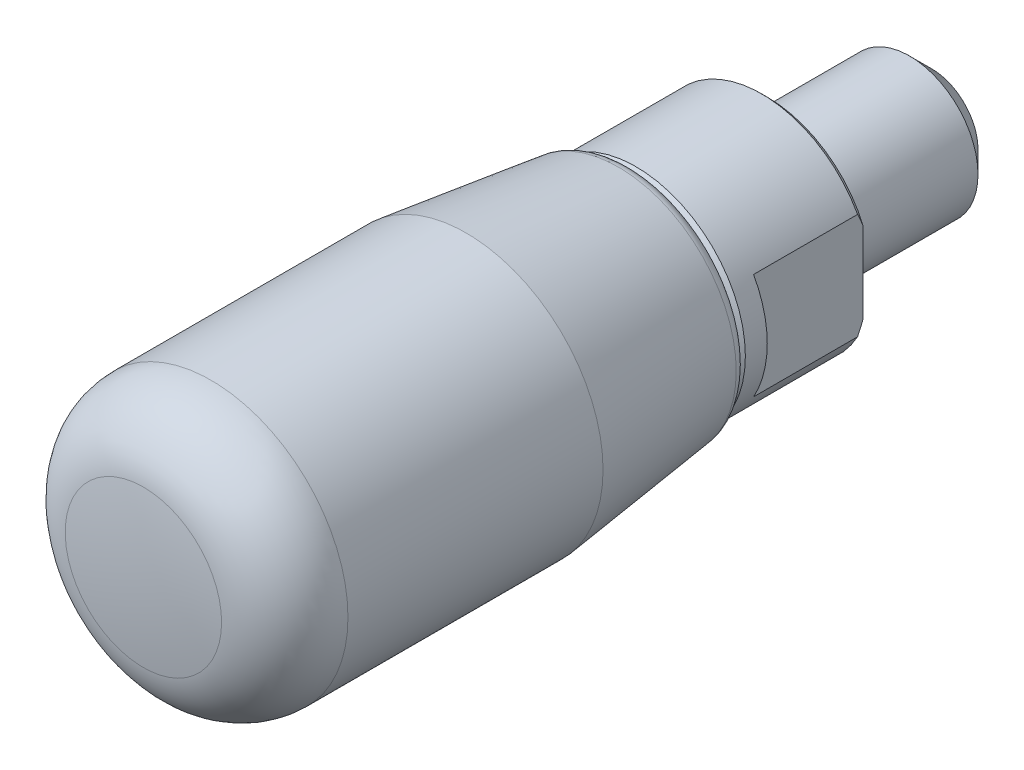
ISO-10303-21;
HEADER;
FILE_DESCRIPTION(('STEP AP214'),'2;1');
FILE_NAME('part.step','',(''),(''),'','','');
FILE_SCHEMA(('AUTOMOTIVE_DESIGN { 1 0 10303 214 1 1 1 1 }'));
ENDSEC;
DATA;
#1=APPLICATION_CONTEXT('core data for automotive mechanical design processes');
#2=APPLICATION_PROTOCOL_DEFINITION('international standard','automotive_design',2000,#1);
#3=PRODUCT_CONTEXT('',#1,'mechanical');
#4=PRODUCT('Part','Part','',(#3));
#5=PRODUCT_RELATED_PRODUCT_CATEGORY('part','',(#4));
#6=PRODUCT_DEFINITION_FORMATION('','',#4);
#7=PRODUCT_DEFINITION_CONTEXT('part definition',#1,'design');
#8=PRODUCT_DEFINITION('design','',#6,#7);
#9=PRODUCT_DEFINITION_SHAPE('','',#8);
#10=(LENGTH_UNIT() NAMED_UNIT(*) SI_UNIT(.MILLI.,.METRE.));
#11=(NAMED_UNIT(*) PLANE_ANGLE_UNIT() SI_UNIT($,.RADIAN.));
#12=(NAMED_UNIT(*) SI_UNIT($,.STERADIAN.) SOLID_ANGLE_UNIT());
#13=UNCERTAINTY_MEASURE_WITH_UNIT(LENGTH_MEASURE(1.E-05),#10,'distance_accuracy_value','');
#14=(GEOMETRIC_REPRESENTATION_CONTEXT(3) GLOBAL_UNCERTAINTY_ASSIGNED_CONTEXT((#13)) GLOBAL_UNIT_ASSIGNED_CONTEXT((#10,
#11,#12)) REPRESENTATION_CONTEXT('',''));
#15=CARTESIAN_POINT('',(0.,0.,0.));
#16=DIRECTION('',(0.,0.,1.));
#17=DIRECTION('',(1.,0.,0.));
#18=AXIS2_PLACEMENT_3D('',#15,#16,#17);
#19=CARTESIAN_POINT('',(0.,3.8,0.));
#20=DIRECTION('',(0.,0.,1.));
#21=DIRECTION('',(1.,0.,0.));
#22=AXIS2_PLACEMENT_3D('',#19,#20,#21);
#23=PLANE('',#22);
#24=CARTESIAN_POINT('',(0.,0.,0.));
#25=DIRECTION('',(0.,0.,1.));
#26=DIRECTION('',(1.,0.,0.));
#27=AXIS2_PLACEMENT_3D('',#24,#25,#26);
#28=CIRCLE('',#27,2.5);
#29=CARTESIAN_POINT('',(2.5,0.,0.));
#30=VERTEX_POINT('',#29);
#31=EDGE_CURVE('E94',#30,#30,#28,.T.);
#32=ORIENTED_EDGE('',*,*,#31,.T.);
#33=EDGE_LOOP('',(#32));
#34=FACE_BOUND('',#33,.T.);
#35=DIRECTION('',(0.,1.,0.));
#36=VECTOR('',#35,1.);
#37=CARTESIAN_POINT('',(-3.5,1.95,0.));
#38=LINE('',#37,#36);
#39=CARTESIAN_POINT('',(-3.5,-1.47986485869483,0.));
#40=VERTEX_POINT('',#39);
#41=CARTESIAN_POINT('',(-3.5,1.47986485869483,0.));
#42=VERTEX_POINT('',#41);
#43=EDGE_CURVE('E68',#40,#42,#38,.T.);
#44=ORIENTED_EDGE('',*,*,#43,.T.);
#45=CARTESIAN_POINT('',(0.,0.,0.));
#46=DIRECTION('',(0.,0.,1.));
#47=DIRECTION('',(1.,0.,0.));
#48=AXIS2_PLACEMENT_3D('',#45,#46,#47);
#49=CIRCLE('',#48,3.8);
#50=CARTESIAN_POINT('',(3.5,1.47986485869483,0.));
#51=VERTEX_POINT('',#50);
#52=EDGE_CURVE('E91',#51,#42,#49,.T.);
#53=ORIENTED_EDGE('',*,*,#52,.F.);
#54=DIRECTION('',(0.,1.,0.));
#55=VECTOR('',#54,1.);
#56=CARTESIAN_POINT('',(3.5,1.95,0.));
#57=LINE('',#56,#55);
#58=CARTESIAN_POINT('',(3.5,-1.47986485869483,0.));
#59=VERTEX_POINT('',#58);
#60=EDGE_CURVE('E90',#59,#51,#57,.T.);
#61=ORIENTED_EDGE('',*,*,#60,.F.);
#62=EDGE_CURVE('E85',#40,#59,#49,.T.);
#63=ORIENTED_EDGE('',*,*,#62,.F.);
#64=EDGE_LOOP('',(#44,#53,#61,#63));
#65=FACE_BOUND('',#64,.T.);
#66=ADVANCED_FACE('F14',(#34,#65),#23,.F.);
#67=CARTESIAN_POINT('',(0.,0.,0.));
#68=DIRECTION('',(0.,0.,1.));
#69=DIRECTION('',(1.,0.,0.));
#70=AXIS2_PLACEMENT_3D('',#67,#68,#69);
#71=CONICAL_SURFACE('',#70,3.8,0.785398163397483);
#72=CARTESIAN_POINT('',(-3.5,4.293274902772,1.73915240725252));
#73=CARTESIAN_POINT('',(-3.5,4.18971726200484,1.6589051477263));
#74=CARTESIAN_POINT('',(-3.5,4.08560978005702,1.57935643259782));
#75=CARTESIAN_POINT('',(-3.5,3.87606716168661,1.42197837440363));
#76=CARTESIAN_POINT('',(-3.5,3.77063172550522,1.34414943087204));
#77=CARTESIAN_POINT('',(-3.5,3.55743563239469,1.18997959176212));
#78=CARTESIAN_POINT('',(-3.5,3.44966332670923,1.11365475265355));
#79=CARTESIAN_POINT('',(-3.5,3.23233727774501,0.963593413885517));
#80=CARTESIAN_POINT('',(-3.5,3.12278365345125,0.88985674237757));
#81=CARTESIAN_POINT('',(-3.5,2.89380510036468,0.740490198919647));
#82=CARTESIAN_POINT('',(-3.5,2.77422807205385,0.665092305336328));
#83=CARTESIAN_POINT('',(-3.5,2.53224330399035,0.518906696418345));
#84=CARTESIAN_POINT('',(-3.5,2.40983508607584,0.448119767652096));
#85=CARTESIAN_POINT('',(-3.5,2.16212089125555,0.312668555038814));
#86=CARTESIAN_POINT('',(-3.5,2.03682456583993,0.247986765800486));
#87=CARTESIAN_POINT('',(-3.5,1.78261830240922,0.126230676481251));
#88=CARTESIAN_POINT('',(-3.5,1.65371009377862,0.0691528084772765));
#89=CARTESIAN_POINT('',(-3.5,1.39638705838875,-0.0335077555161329));
#90=CARTESIAN_POINT('',(-3.5,1.26810310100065,-0.0794140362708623));
#91=CARTESIAN_POINT('',(-3.5,1.007956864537,-0.159848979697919));
#92=CARTESIAN_POINT('',(-3.5,0.876094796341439,-0.194378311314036));
#93=CARTESIAN_POINT('',(-3.5,0.612545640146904,-0.24908341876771));
#94=CARTESIAN_POINT('',(-3.5,0.480925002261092,-0.269572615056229));
#95=CARTESIAN_POINT('',(-3.5,0.216213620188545,-0.295798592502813));
#96=CARTESIAN_POINT('',(-3.5,0.0831232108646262,-0.301538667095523));
#97=CARTESIAN_POINT('',(-3.5,-0.183534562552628,-0.297741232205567));
#98=CARTESIAN_POINT('',(-3.5,-0.317100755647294,-0.288123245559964));
#99=CARTESIAN_POINT('',(-3.5,-0.582366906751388,-0.25432462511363));
#100=CARTESIAN_POINT('',(-3.5,-0.714066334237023,-0.23013993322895));
#101=CARTESIAN_POINT('',(-3.5,-0.97750962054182,-0.168372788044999));
#102=CARTESIAN_POINT('',(-3.5,-1.10918090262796,-0.130487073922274));
#103=CARTESIAN_POINT('',(-3.5,-1.36883485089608,-0.0438437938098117));
#104=CARTESIAN_POINT('',(-3.5,-1.49681737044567,0.00491420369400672));
#105=CARTESIAN_POINT('',(-3.5,-1.74851374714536,0.110795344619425));
#106=CARTESIAN_POINT('',(-3.5,-1.87224490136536,0.167877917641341));
#107=CARTESIAN_POINT('',(-3.5,-2.11640840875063,0.288756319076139));
#108=CARTESIAN_POINT('',(-3.5,-2.23683948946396,0.35255469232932));
#109=CARTESIAN_POINT('',(-3.5,-2.47503815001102,0.485560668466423));
#110=CARTESIAN_POINT('',(-3.5,-2.59279855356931,0.554781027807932));
#111=CARTESIAN_POINT('',(-3.5,-2.8257431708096,0.697370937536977));
#112=CARTESIAN_POINT('',(-3.5,-2.94092774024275,0.770739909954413));
#113=CARTESIAN_POINT('',(-3.5,-3.16170091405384,0.915919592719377));
#114=CARTESIAN_POINT('',(-3.5,-3.26742700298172,0.987522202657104));
#115=CARTESIAN_POINT('',(-3.5,-3.47723756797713,1.13310021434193));
#116=CARTESIAN_POINT('',(-3.5,-3.58132195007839,1.2070757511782));
#117=CARTESIAN_POINT('',(-3.5,-3.78741463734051,1.35650033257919));
#118=CARTESIAN_POINT('',(-3.5,-3.88943193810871,1.43193700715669));
#119=CARTESIAN_POINT('',(-3.5,-4.09222968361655,1.58441463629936));
#120=CARTESIAN_POINT('',(-3.5,-4.19301037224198,1.66145526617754));
#121=CARTESIAN_POINT('',(-3.5,-4.29327490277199,1.7391524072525));
#122=B_SPLINE_CURVE_WITH_KNOTS('',3,(#72,#73,#74,#75,#76,#77,#78,#79,#80,#81,#82,#83,#84,#85,
#86,#87,#88,#89,#90,#91,#92,#93,#94,#95,#96,#97,#98,#99,#100,#101,#102,#103,#104,#105,#106,#107,
#108,#109,#110,#111,#112,#113,#114,#115,#116,#117,#118,#119,#120,#121),.UNSPECIFIED.,.F.,.F.,(4,
2,2,2,2,2,2,2,2,2,2,2,2,2,2,2,2,2,2,2,2,2,2,2,4),(0.,0.393039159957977,0.786168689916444,
1.18232297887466,1.57845091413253,2.00245733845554,2.42653590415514,2.84935900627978,
3.27198300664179,3.6803081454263,4.08860927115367,4.48746972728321,4.88624111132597,
5.28710894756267,5.68808851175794,6.09854897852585,6.50902573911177,6.91756501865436,
7.3262596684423,7.73594654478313,8.14557648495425,8.52861111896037,8.91166759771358,
9.29228685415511,9.6728297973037),.UNSPECIFIED.);
#123=CARTESIAN_POINT('',(-3.5,1.93649167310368,0.2));
#124=VERTEX_POINT('',#123);
#125=EDGE_CURVE('E74',#124,#42,#122,.T.);
#126=ORIENTED_EDGE('',*,*,#125,.F.);
#127=CARTESIAN_POINT('',(0.,0.,0.2));
#128=DIRECTION('',(0.,0.,1.));
#129=DIRECTION('',(1.,0.,0.));
#130=AXIS2_PLACEMENT_3D('',#127,#128,#129);
#131=CIRCLE('',#130,4.);
#132=CARTESIAN_POINT('',(3.5,1.93649167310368,0.2));
#133=VERTEX_POINT('',#132);
#134=EDGE_CURVE('E92',#133,#124,#131,.T.);
#135=ORIENTED_EDGE('',*,*,#134,.F.);
#136=CARTESIAN_POINT('',(3.5,-4.29327490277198,1.7391524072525));
#137=CARTESIAN_POINT('',(3.5,-4.18971726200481,1.65890514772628));
#138=CARTESIAN_POINT('',(3.5,-4.085609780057,1.5793564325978));
#139=CARTESIAN_POINT('',(3.5,-3.87606716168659,1.42197837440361));
#140=CARTESIAN_POINT('',(3.5,-3.7706317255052,1.34414943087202));
#141=CARTESIAN_POINT('',(3.5,-3.55743563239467,1.1899795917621));
#142=CARTESIAN_POINT('',(3.5,-3.44966332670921,1.11365475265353));
#143=CARTESIAN_POINT('',(3.5,-3.23233727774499,0.963593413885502));
#144=CARTESIAN_POINT('',(3.5,-3.12278365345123,0.889856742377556));
#145=CARTESIAN_POINT('',(3.5,-2.89380510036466,0.740490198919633));
#146=CARTESIAN_POINT('',(3.5,-2.77422807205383,0.665092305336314));
#147=CARTESIAN_POINT('',(3.5,-2.53224330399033,0.518906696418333));
#148=CARTESIAN_POINT('',(3.5,-2.40983508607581,0.448119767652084));
#149=CARTESIAN_POINT('',(3.5,-2.16212089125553,0.312668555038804));
#150=CARTESIAN_POINT('',(3.5,-2.03682456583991,0.247986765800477));
#151=CARTESIAN_POINT('',(3.5,-1.78261830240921,0.126230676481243));
#152=CARTESIAN_POINT('',(3.5,-1.65371009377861,0.0691528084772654));
#153=CARTESIAN_POINT('',(3.5,-1.39638705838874,-0.0335077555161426));
#154=CARTESIAN_POINT('',(3.5,-1.26810310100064,-0.0794140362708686));
#155=CARTESIAN_POINT('',(3.5,-1.00795686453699,-0.159848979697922));
#156=CARTESIAN_POINT('',(3.5,-0.876094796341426,-0.194378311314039));
#157=CARTESIAN_POINT('',(3.5,-0.612545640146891,-0.249083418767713));
#158=CARTESIAN_POINT('',(3.5,-0.48092500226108,-0.269572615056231));
#159=CARTESIAN_POINT('',(3.5,-0.216213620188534,-0.295798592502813));
#160=CARTESIAN_POINT('',(3.5,-0.0831232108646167,-0.301538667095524));
#161=CARTESIAN_POINT('',(3.5,0.183534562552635,-0.297741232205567));
#162=CARTESIAN_POINT('',(3.5,0.317100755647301,-0.288123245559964));
#163=CARTESIAN_POINT('',(3.5,0.582366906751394,-0.254324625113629));
#164=CARTESIAN_POINT('',(3.5,0.714066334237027,-0.230139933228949));
#165=CARTESIAN_POINT('',(3.5,0.977509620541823,-0.168372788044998));
#166=CARTESIAN_POINT('',(3.5,1.10918090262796,-0.130487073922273));
#167=CARTESIAN_POINT('',(3.5,1.36883485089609,-0.0438437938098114));
#168=CARTESIAN_POINT('',(3.5,1.49681737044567,0.00491420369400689));
#169=CARTESIAN_POINT('',(3.5,1.74851374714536,0.110795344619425));
#170=CARTESIAN_POINT('',(3.5,1.87224490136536,0.167877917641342));
#171=CARTESIAN_POINT('',(3.5,2.11640840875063,0.288756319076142));
#172=CARTESIAN_POINT('',(3.5,2.23683948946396,0.352554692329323));
#173=CARTESIAN_POINT('',(3.5,2.47503815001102,0.485560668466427));
#174=CARTESIAN_POINT('',(3.5,2.59279855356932,0.554781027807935));
#175=CARTESIAN_POINT('',(3.5,2.82574317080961,0.697370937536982));
#176=CARTESIAN_POINT('',(3.5,2.94092774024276,0.770739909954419));
#177=CARTESIAN_POINT('',(3.5,3.16170091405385,0.915919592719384));
#178=CARTESIAN_POINT('',(3.5,3.26742700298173,0.987522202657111));
#179=CARTESIAN_POINT('',(3.5,3.47723756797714,1.13310021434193));
#180=CARTESIAN_POINT('',(3.5,3.5813219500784,1.20707575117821));
#181=CARTESIAN_POINT('',(3.5,3.78741463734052,1.3565003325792));
#182=CARTESIAN_POINT('',(3.5,3.88943193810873,1.4319370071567));
#183=CARTESIAN_POINT('',(3.5,4.09222968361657,1.58441463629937));
#184=CARTESIAN_POINT('',(3.5,4.19301037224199,1.66145526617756));
#185=CARTESIAN_POINT('',(3.5,4.293274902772,1.73915240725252));
#186=B_SPLINE_CURVE_WITH_KNOTS('',3,(#136,#137,#138,#139,#140,#141,#142,#143,#144,#145,#146,
#147,#148,#149,#150,#151,#152,#153,#154,#155,#156,#157,#158,#159,#160,#161,#162,#163,#164,#165,
#166,#167,#168,#169,#170,#171,#172,#173,#174,#175,#176,#177,#178,#179,#180,#181,#182,#183,#184,
#185),.UNSPECIFIED.,.F.,.F.,(4,2,2,2,2,2,2,2,2,2,2,2,2,2,2,2,2,2,2,2,2,2,2,2,4),(0.,
0.393039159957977,0.786168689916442,1.18232297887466,1.57845091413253,2.00245733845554,
2.42653590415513,2.84935900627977,3.27198300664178,3.68030814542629,4.08860927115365,
4.48746972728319,4.88624111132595,5.28710894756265,5.68808851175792,6.09854897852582,
6.50902573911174,6.91756501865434,7.32625966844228,7.73594654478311,8.14557648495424,
8.52861111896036,8.91166759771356,9.2922868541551,9.6728297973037),.UNSPECIFIED.);
#187=EDGE_CURVE('E152',#51,#133,#186,.T.);
#188=ORIENTED_EDGE('',*,*,#187,.F.);
#189=ORIENTED_EDGE('',*,*,#52,.T.);
#190=EDGE_LOOP('',(#126,#135,#188,#189));
#191=FACE_BOUND('',#190,.T.);
#192=ADVANCED_FACE('F121',(#191),#71,.T.);
#193=CARTESIAN_POINT('',(-3.5,-1.93649167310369,0.2));
#194=VERTEX_POINT('',#193);
#195=EDGE_CURVE('E71',#40,#194,#122,.T.);
#196=ORIENTED_EDGE('',*,*,#195,.F.);
#197=ORIENTED_EDGE('',*,*,#62,.T.);
#198=CARTESIAN_POINT('',(3.5,-1.93649167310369,0.2));
#199=VERTEX_POINT('',#198);
#200=EDGE_CURVE('E146',#199,#59,#186,.T.);
#201=ORIENTED_EDGE('',*,*,#200,.F.);
#202=EDGE_CURVE('E87',#194,#199,#131,.T.);
#203=ORIENTED_EDGE('',*,*,#202,.F.);
#204=EDGE_LOOP('',(#196,#197,#201,#203));
#205=FACE_BOUND('',#204,.T.);
#206=ADVANCED_FACE('F83',(#205),#71,.T.);
#207=CARTESIAN_POINT('',(0.,0.,25.5));
#208=DIRECTION('',(0.,0.,1.));
#209=DIRECTION('',(1.,0.,0.));
#210=AXIS2_PLACEMENT_3D('',#207,#208,#209);
#211=CYLINDRICAL_SURFACE('',#210,4.);
#212=CARTESIAN_POINT('',(0.,0.,4.8));
#213=DIRECTION('',(0.,0.,1.));
#214=DIRECTION('',(1.,0.,0.));
#215=AXIS2_PLACEMENT_3D('',#212,#213,#214);
#216=CIRCLE('',#215,4.);
#217=CARTESIAN_POINT('',(4.,0.,4.8));
#218=VERTEX_POINT('',#217);
#219=EDGE_CURVE('E170',#218,#218,#216,.T.);
#220=ORIENTED_EDGE('',*,*,#219,.F.);
#221=EDGE_LOOP('',(#220));
#222=FACE_BOUND('',#221,.T.);
#223=DIRECTION('',(0.,0.,1.));
#224=VECTOR('',#223,1.);
#225=CARTESIAN_POINT('',(-3.5,1.93649167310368,25.5));
#226=LINE('',#225,#224);
#227=CARTESIAN_POINT('',(-3.5,1.93649167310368,4.));
#228=VERTEX_POINT('',#227);
#229=EDGE_CURVE('E9',#228,#124,#226,.F.);
#230=ORIENTED_EDGE('',*,*,#229,.F.);
#231=CARTESIAN_POINT('',(0.,0.,4.));
#232=DIRECTION('',(0.,0.,-1.));
#233=DIRECTION('',(-1.,0.,0.));
#234=AXIS2_PLACEMENT_3D('',#231,#232,#233);
#235=CIRCLE('',#234,4.);
#236=CARTESIAN_POINT('',(-3.5,-1.93649167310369,4.));
#237=VERTEX_POINT('',#236);
#238=EDGE_CURVE('E28',#237,#228,#235,.T.);
#239=ORIENTED_EDGE('',*,*,#238,.F.);
#240=DIRECTION('',(0.,0.,1.));
#241=VECTOR('',#240,1.);
#242=CARTESIAN_POINT('',(-3.5,-1.93649167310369,25.5));
#243=LINE('',#242,#241);
#244=EDGE_CURVE('E22',#194,#237,#243,.T.);
#245=ORIENTED_EDGE('',*,*,#244,.F.);
#246=ORIENTED_EDGE('',*,*,#202,.T.);
#247=DIRECTION('',(0.,0.,1.));
#248=VECTOR('',#247,1.);
#249=CARTESIAN_POINT('',(3.5,-1.93649167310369,25.5));
#250=LINE('',#249,#248);
#251=CARTESIAN_POINT('',(3.5,-1.93649167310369,4.));
#252=VERTEX_POINT('',#251);
#253=EDGE_CURVE('E109',#252,#199,#250,.F.);
#254=ORIENTED_EDGE('',*,*,#253,.F.);
#255=CARTESIAN_POINT('',(0.,0.,4.));
#256=DIRECTION('',(0.,0.,1.));
#257=DIRECTION('',(1.,0.,0.));
#258=AXIS2_PLACEMENT_3D('',#255,#256,#257);
#259=CIRCLE('',#258,4.);
#260=CARTESIAN_POINT('',(3.5,1.93649167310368,4.));
#261=VERTEX_POINT('',#260);
#262=EDGE_CURVE('E107',#252,#261,#259,.T.);
#263=ORIENTED_EDGE('',*,*,#262,.T.);
#264=DIRECTION('',(0.,0.,1.));
#265=VECTOR('',#264,1.);
#266=CARTESIAN_POINT('',(3.5,1.93649167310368,25.5));
#267=LINE('',#266,#265);
#268=EDGE_CURVE('E111',#133,#261,#267,.T.);
#269=ORIENTED_EDGE('',*,*,#268,.F.);
#270=ORIENTED_EDGE('',*,*,#134,.T.);
#271=EDGE_LOOP('',(#230,#239,#245,#246,#254,#263,#269,#270));
#272=FACE_BOUND('',#271,.T.);
#273=ADVANCED_FACE('F117',(#222,#272),#211,.T.);
#274=CARTESIAN_POINT('',(0.,1.7,-6.));
#275=DIRECTION('',(0.,0.,1.));
#276=DIRECTION('',(1.,0.,0.));
#277=AXIS2_PLACEMENT_3D('',#274,#275,#276);
#278=PLANE('',#277);
#279=CARTESIAN_POINT('',(0.,0.,-6.));
#280=DIRECTION('',(0.,0.,1.));
#281=DIRECTION('',(1.,0.,0.));
#282=AXIS2_PLACEMENT_3D('',#279,#280,#281);
#283=CIRCLE('',#282,1.7);
#284=CARTESIAN_POINT('',(1.7,0.,-6.));
#285=VERTEX_POINT('',#284);
#286=EDGE_CURVE('E104',#285,#285,#283,.T.);
#287=ORIENTED_EDGE('',*,*,#286,.F.);
#288=EDGE_LOOP('',(#287));
#289=FACE_BOUND('',#288,.T.);
#290=ADVANCED_FACE('F16',(#289),#278,.F.);
#291=CARTESIAN_POINT('',(0.,0.,-6.));
#292=DIRECTION('',(0.,0.,1.));
#293=DIRECTION('',(1.,0.,0.));
#294=AXIS2_PLACEMENT_3D('',#291,#292,#293);
#295=CONICAL_SURFACE('',#294,1.7,0.785398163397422);
#296=CARTESIAN_POINT('',(0.,0.,-5.19999999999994));
#297=DIRECTION('',(0.,0.,1.));
#298=DIRECTION('',(1.,0.,0.));
#299=AXIS2_PLACEMENT_3D('',#296,#297,#298);
#300=CIRCLE('',#299,2.5);
#301=CARTESIAN_POINT('',(2.5,0.,-5.19999999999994));
#302=VERTEX_POINT('',#301);
#303=EDGE_CURVE('E101',#302,#302,#300,.T.);
#304=ORIENTED_EDGE('',*,*,#303,.F.);
#305=EDGE_LOOP('',(#304));
#306=FACE_BOUND('',#305,.T.);
#307=ORIENTED_EDGE('',*,*,#286,.T.);
#308=EDGE_LOOP('',(#307));
#309=FACE_BOUND('',#308,.T.);
#310=ADVANCED_FACE('F195',(#306,#309),#295,.T.);
#311=CARTESIAN_POINT('',(0.,0.,25.5));
#312=DIRECTION('',(0.,0.,1.));
#313=DIRECTION('',(1.,0.,0.));
#314=AXIS2_PLACEMENT_3D('',#311,#312,#313);
#315=CYLINDRICAL_SURFACE('',#314,2.5);
#316=ORIENTED_EDGE('',*,*,#31,.F.);
#317=EDGE_LOOP('',(#316));
#318=FACE_BOUND('',#317,.T.);
#319=ORIENTED_EDGE('',*,*,#303,.T.);
#320=EDGE_LOOP('',(#319));
#321=FACE_BOUND('',#320,.T.);
#322=ADVANCED_FACE('F192',(#318,#321),#315,.T.);
#323=CARTESIAN_POINT('',(0.,0.,4.8));
#324=DIRECTION('',(0.,0.,-1.));
#325=DIRECTION('',(-1.,0.,0.));
#326=AXIS2_PLACEMENT_3D('',#323,#324,#325);
#327=CONICAL_SURFACE('',#326,4.,0.785398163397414);
#328=CARTESIAN_POINT('',(0.,0.,5.));
#329=DIRECTION('',(0.,0.,1.));
#330=DIRECTION('',(1.,0.,0.));
#331=AXIS2_PLACEMENT_3D('',#328,#329,#330);
#332=CIRCLE('',#331,3.8);
#333=CARTESIAN_POINT('',(3.8,0.,5.));
#334=VERTEX_POINT('',#333);
#335=EDGE_CURVE('E168',#334,#334,#332,.T.);
#336=ORIENTED_EDGE('',*,*,#335,.F.);
#337=EDGE_LOOP('',(#336));
#338=FACE_BOUND('',#337,.T.);
#339=ORIENTED_EDGE('',*,*,#219,.T.);
#340=EDGE_LOOP('',(#339));
#341=FACE_BOUND('',#340,.T.);
#342=ADVANCED_FACE('F194',(#338,#341),#327,.T.);
#343=CARTESIAN_POINT('',(0.,3.80860889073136,5.));
#344=DIRECTION('',(0.,0.,1.));
#345=DIRECTION('',(1.,0.,0.));
#346=AXIS2_PLACEMENT_3D('',#343,#344,#345);
#347=PLANE('',#346);
#348=CARTESIAN_POINT('',(0.,0.,5.));
#349=DIRECTION('',(0.,0.,1.));
#350=DIRECTION('',(1.,0.,0.));
#351=AXIS2_PLACEMENT_3D('',#348,#349,#350);
#352=CIRCLE('',#351,3.80860889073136);
#353=CARTESIAN_POINT('',(3.80860889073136,0.,5.));
#354=VERTEX_POINT('',#353);
#355=EDGE_CURVE('E165',#354,#354,#352,.T.);
#356=ORIENTED_EDGE('',*,*,#355,.F.);
#357=EDGE_LOOP('',(#356));
#358=FACE_BOUND('',#357,.T.);
#359=ORIENTED_EDGE('',*,*,#335,.T.);
#360=EDGE_LOOP('',(#359));
#361=FACE_BOUND('',#360,.T.);
#362=ADVANCED_FACE('F220',(#358,#361),#347,.F.);
#363=CARTESIAN_POINT('',(0.,0.,5.5));
#364=DIRECTION('',(0.,0.,1.));
#365=DIRECTION('',(1.,0.,0.));
#366=AXIS2_PLACEMENT_3D('',#363,#364,#365);
#367=TOROIDAL_SURFACE('',#366,3.80860889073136,0.5);
#368=CARTESIAN_POINT('',(0.,0.,5.4379826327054));
#369=DIRECTION('',(0.,0.,1.));
#370=DIRECTION('',(1.,0.,0.));
#371=AXIS2_PLACEMENT_3D('',#368,#369,#370);
#372=CIRCLE('',#371,4.30474782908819);
#373=CARTESIAN_POINT('',(4.30474782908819,0.,5.4379826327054));
#374=VERTEX_POINT('',#373);
#375=EDGE_CURVE('E162',#374,#374,#372,.T.);
#376=ORIENTED_EDGE('',*,*,#375,.F.);
#377=EDGE_LOOP('',(#376));
#378=FACE_BOUND('',#377,.T.);
#379=ORIENTED_EDGE('',*,*,#355,.T.);
#380=EDGE_LOOP('',(#379));
#381=FACE_BOUND('',#380,.T.);
#382=ADVANCED_FACE('F224',(#378,#381),#367,.T.);
#383=CARTESIAN_POINT('',(0.,0.,5.4379826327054));
#384=DIRECTION('',(0.,0.,1.));
#385=DIRECTION('',(1.,0.,0.));
#386=AXIS2_PLACEMENT_3D('',#383,#384,#385);
#387=CONICAL_SURFACE('',#386,4.30474782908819,0.124354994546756);
#388=CARTESIAN_POINT('',(0.,0.,11.));
#389=DIRECTION('',(0.,0.,1.));
#390=DIRECTION('',(1.,0.,0.));
#391=AXIS2_PLACEMENT_3D('',#388,#389,#390);
#392=CIRCLE('',#391,5.);
#393=CARTESIAN_POINT('',(5.,0.,11.));
#394=VERTEX_POINT('',#393);
#395=EDGE_CURVE('E159',#394,#394,#392,.T.);
#396=ORIENTED_EDGE('',*,*,#395,.F.);
#397=EDGE_LOOP('',(#396));
#398=FACE_BOUND('',#397,.T.);
#399=ORIENTED_EDGE('',*,*,#375,.T.);
#400=EDGE_LOOP('',(#399));
#401=FACE_BOUND('',#400,.T.);
#402=ADVANCED_FACE('F228',(#398,#401),#387,.T.);
#403=CARTESIAN_POINT('',(0.,0.,25.5));
#404=DIRECTION('',(0.,0.,1.));
#405=DIRECTION('',(1.,0.,0.));
#406=AXIS2_PLACEMENT_3D('',#403,#404,#405);
#407=CYLINDRICAL_SURFACE('',#406,5.);
#408=CARTESIAN_POINT('',(0.,0.,20.3205080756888));
#409=DIRECTION('',(0.,0.,1.));
#410=DIRECTION('',(1.,0.,0.));
#411=AXIS2_PLACEMENT_3D('',#408,#409,#410);
#412=CIRCLE('',#411,5.);
#413=CARTESIAN_POINT('',(5.,0.,20.3205080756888));
#414=VERTEX_POINT('',#413);
#415=EDGE_CURVE('E156',#414,#414,#412,.T.);
#416=ORIENTED_EDGE('',*,*,#415,.F.);
#417=EDGE_LOOP('',(#416));
#418=FACE_BOUND('',#417,.T.);
#419=ORIENTED_EDGE('',*,*,#395,.T.);
#420=EDGE_LOOP('',(#419));
#421=FACE_BOUND('',#420,.T.);
#422=ADVANCED_FACE('F232',(#418,#421),#407,.T.);
#423=CARTESIAN_POINT('',(0.,0.,20.3205080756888));
#424=DIRECTION('',(0.,0.,1.));
#425=DIRECTION('',(1.,0.,0.));
#426=AXIS2_PLACEMENT_3D('',#423,#424,#425);
#427=DEGENERATE_TOROIDAL_SURFACE('',#426,2.5,2.5,.T.);
#428=CARTESIAN_POINT('',(0.,0.,22.7948663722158));
#429=DIRECTION('',(0.,0.,1.));
#430=DIRECTION('',(1.,0.,0.));
#431=AXIS2_PLACEMENT_3D('',#428,#429,#430);
#432=CIRCLE('',#431,2.85714285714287);
#433=CARTESIAN_POINT('',(2.85714285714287,0.,22.7948663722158));
#434=VERTEX_POINT('',#433);
#435=EDGE_CURVE('E153',#434,#434,#432,.T.);
#436=ORIENTED_EDGE('',*,*,#435,.F.);
#437=EDGE_LOOP('',(#436));
#438=FACE_BOUND('',#437,.T.);
#439=ORIENTED_EDGE('',*,*,#415,.T.);
#440=EDGE_LOOP('',(#439));
#441=FACE_BOUND('',#440,.T.);
#442=ADVANCED_FACE('F183',(#438,#441),#427,.T.);
#443=CARTESIAN_POINT('',(0.,0.,3.));
#444=DIRECTION('',(0.,0.,1.));
#445=DIRECTION('',(0.,1.,0.));
#446=AXIS2_PLACEMENT_3D('',#443,#444,#445);
#447=SPHERICAL_SURFACE('',#446,20.);
#448=ORIENTED_EDGE('',*,*,#435,.T.);
#449=EDGE_LOOP('',(#448));
#450=FACE_BOUND('',#449,.T.);
#451=ADVANCED_FACE('F177',(#450),#447,.T.);
#452=CARTESIAN_POINT('',(3.5,1.95,4.));
#453=DIRECTION('',(0.,0.,1.));
#454=DIRECTION('',(1.,0.,0.));
#455=AXIS2_PLACEMENT_3D('',#452,#453,#454);
#456=PLANE('',#455);
#457=ORIENTED_EDGE('',*,*,#262,.F.);
#458=DIRECTION('',(0.,-1.,0.));
#459=VECTOR('',#458,1.);
#460=CARTESIAN_POINT('',(3.5,1.95,4.));
#461=LINE('',#460,#459);
#462=EDGE_CURVE('E36',#261,#252,#461,.T.);
#463=ORIENTED_EDGE('',*,*,#462,.F.);
#464=EDGE_LOOP('',(#457,#463));
#465=FACE_BOUND('',#464,.T.);
#466=ADVANCED_FACE('F143',(#465),#456,.F.);
#467=CARTESIAN_POINT('',(3.5,-1.95,4.));
#468=DIRECTION('',(1.,0.,0.));
#469=DIRECTION('',(0.,0.,-1.));
#470=AXIS2_PLACEMENT_3D('',#467,#468,#469);
#471=PLANE('',#470);
#472=ORIENTED_EDGE('',*,*,#187,.T.);
#473=ORIENTED_EDGE('',*,*,#268,.T.);
#474=ORIENTED_EDGE('',*,*,#462,.T.);
#475=ORIENTED_EDGE('',*,*,#253,.T.);
#476=ORIENTED_EDGE('',*,*,#200,.T.);
#477=ORIENTED_EDGE('',*,*,#60,.T.);
#478=EDGE_LOOP('',(#472,#473,#474,#475,#476,#477));
#479=FACE_BOUND('',#478,.T.);
#480=ADVANCED_FACE('F139',(#479),#471,.T.);
#481=CARTESIAN_POINT('',(-3.5,1.95,4.));
#482=DIRECTION('',(0.,0.,-1.));
#483=DIRECTION('',(-1.,0.,0.));
#484=AXIS2_PLACEMENT_3D('',#481,#482,#483);
#485=PLANE('',#484);
#486=ORIENTED_EDGE('',*,*,#238,.T.);
#487=DIRECTION('',(0.,-1.,0.));
#488=VECTOR('',#487,1.);
#489=CARTESIAN_POINT('',(-3.5,1.95,4.));
#490=LINE('',#489,#488);
#491=EDGE_CURVE('E79',#228,#237,#490,.T.);
#492=ORIENTED_EDGE('',*,*,#491,.T.);
#493=EDGE_LOOP('',(#486,#492));
#494=FACE_BOUND('',#493,.T.);
#495=ADVANCED_FACE('F115',(#494),#485,.T.);
#496=CARTESIAN_POINT('',(-3.5,-1.95,0.));
#497=DIRECTION('',(-1.,0.,0.));
#498=DIRECTION('',(0.,0.,1.));
#499=AXIS2_PLACEMENT_3D('',#496,#497,#498);
#500=PLANE('',#499);
#501=ORIENTED_EDGE('',*,*,#195,.T.);
#502=ORIENTED_EDGE('',*,*,#244,.T.);
#503=ORIENTED_EDGE('',*,*,#491,.F.);
#504=ORIENTED_EDGE('',*,*,#229,.T.);
#505=ORIENTED_EDGE('',*,*,#125,.T.);
#506=ORIENTED_EDGE('',*,*,#43,.F.);
#507=EDGE_LOOP('',(#501,#502,#503,#504,#505,#506));
#508=FACE_BOUND('',#507,.T.);
#509=ADVANCED_FACE('F70',(#508),#500,.T.);
#510=CLOSED_SHELL('',(#66,#192,#206,#273,#290,#310,#322,#342,#362,#382,#402,#422,#442,#451,#466,
#480,#495,#509));
#511=MANIFOLD_SOLID_BREP('B1',#510);
#512=ADVANCED_BREP_SHAPE_REPRESENTATION('',(#18,#511),#14);
#513=SHAPE_DEFINITION_REPRESENTATION(#9,#512);
ENDSEC;
END-ISO-10303-21;
